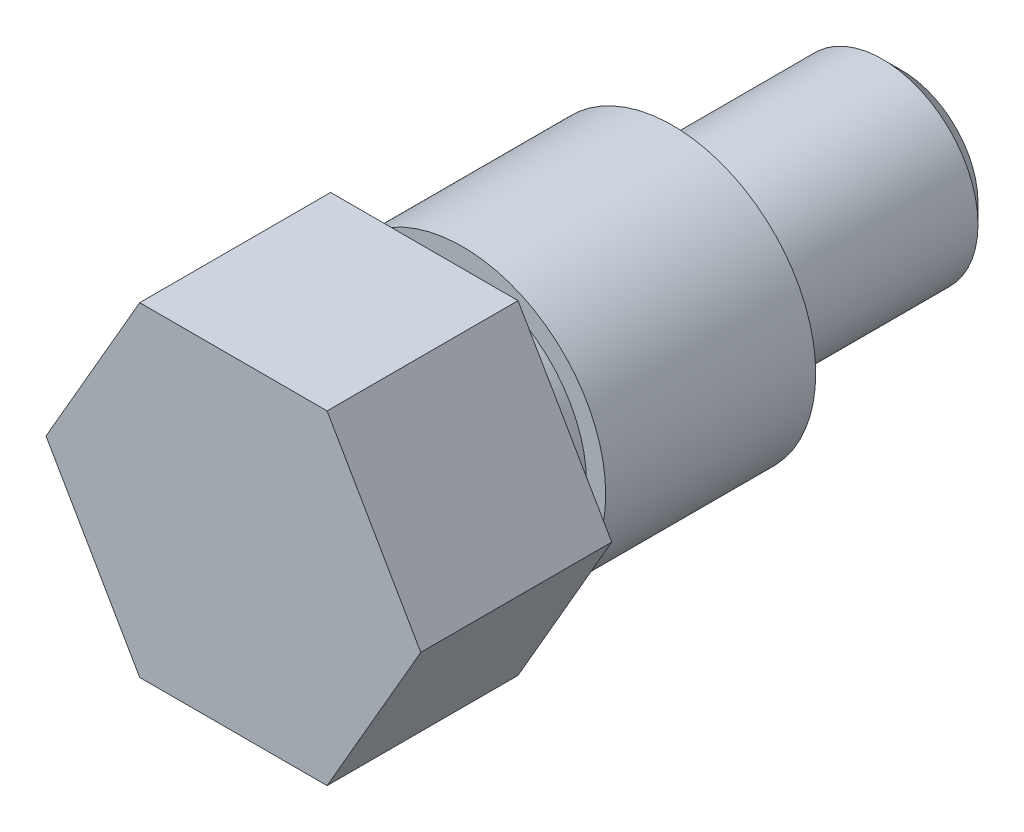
from build123d import *

# Parameters (mm, degrees)
EXTRUSION1_DEPTH        = 35
ESQUISSE2_OUTSIDE_W     = 30.346
ESQUISSE2_OUTSIDE_H     = 27.716
ESQUISSE2_OUTSIDE_R     = 7.5
ENL_V_MAT_EXTRU_1_DEPTH = 13
ESQUISSE3_OUTSIDE_W     = 30.346
ESQUISSE3_OUTSIDE_H     = 27.716
ESQUISSE3_OUTSIDE_R     = 5
ENL_V_MAT_EXTRU_2_DEPTH = 15
ESQUISSE4_OUTSIDE_W     = 30.346
ESQUISSE4_OUTSIDE_H     = 27.716
ESQUISSE4_OUTSIDE_R     = 6.5
ENL_V_MAT_EXTRU_4_DEPTH = 2
CHANFREIN1_SIZE         = 1
ESQUISSE5_W             = 4
ESQUISSE5_H             = 1.5


with BuildPart() as part:
    # Esquisse1 → Extrusion1 (new body)
    with BuildSketch(Plane.XY):
        Polygon((-4.907477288, 8.5), (4.907477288, 8.5), (9.814954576, 0), (4.907477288, -8.5), (-4.907477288, -8.5), (-9.814954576, 0), align=None)
    extrude(amount=-EXTRUSION1_DEPTH)

    # Esquisse2 outside → Enl_v. mat.-Extru.1 (cut)
    with BuildSketch(Plane.XY.offset(-10)):
        Rectangle(ESQUISSE2_OUTSIDE_W, ESQUISSE2_OUTSIDE_H)
        Circle(ESQUISSE2_OUTSIDE_R, mode=Mode.SUBTRACT)
    extrude(amount=-ENL_V_MAT_EXTRU_1_DEPTH, mode=Mode.SUBTRACT)

    # Esquisse3 outside → Enl_v. mat.-Extru.2 (cut)
    with BuildSketch(Plane.XY.offset(-23)):
        Rectangle(ESQUISSE3_OUTSIDE_W, ESQUISSE3_OUTSIDE_H)
        Circle(ESQUISSE3_OUTSIDE_R, mode=Mode.SUBTRACT)
    extrude(amount=-ENL_V_MAT_EXTRU_2_DEPTH, mode=Mode.SUBTRACT)

    # Esquisse4 outside → Enl_v. mat.-Extru.4 (cut)
    with BuildSketch(Plane.XY.offset(-10)):
        Rectangle(ESQUISSE4_OUTSIDE_W, ESQUISSE4_OUTSIDE_H)
        Circle(ESQUISSE4_OUTSIDE_R, mode=Mode.SUBTRACT)
    extrude(amount=-ENL_V_MAT_EXTRU_4_DEPTH, mode=Mode.SUBTRACT)

    # Chanfrein1
    chanfrein1_edges = [part.edges().sort_by_distance(p)[0] for p in [
        (-5, 0, -35),
    ]]
    chamfer(chanfrein1_edges, length=CHANFREIN1_SIZE)

    # Esquisse5 → Enl_vement de mati_re-R_volution1 (revolve, cut)
    with BuildSketch(Plane(origin=(0, 0, 0), x_dir=(1, 0, 0), z_dir=(0, 1, 0)), mode=Mode.PRIVATE) as enl_vement_de_mati_re_r_volution1_sk:
        with Locations((5.5, 23.75)):
            Rectangle(ESQUISSE5_W, ESQUISSE5_H)
    revolve(enl_vement_de_mati_re_r_volution1_sk.sketch.rotate(Axis((0, 0, -23), (0, 0, 1)), 180), axis=Axis((0, 0, -23), (0, 0, 1)), mode=Mode.SUBTRACT)


solid = part.part
